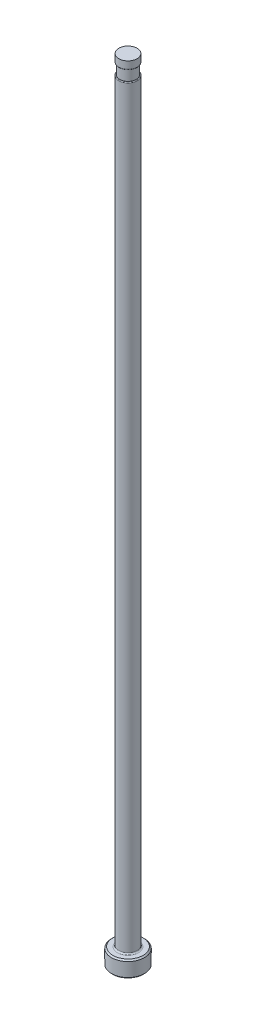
ISO-10303-21;
HEADER;
FILE_DESCRIPTION(('STEP AP214'),'2;1');
FILE_NAME('part.step','',(''),(''),'','','');
FILE_SCHEMA(('AUTOMOTIVE_DESIGN { 1 0 10303 214 1 1 1 1 }'));
ENDSEC;
DATA;
#1=APPLICATION_CONTEXT('core data for automotive mechanical design processes');
#2=APPLICATION_PROTOCOL_DEFINITION('international standard','automotive_design',2000,#1);
#3=PRODUCT_CONTEXT('',#1,'mechanical');
#4=PRODUCT('Part','Part','',(#3));
#5=PRODUCT_RELATED_PRODUCT_CATEGORY('part','',(#4));
#6=PRODUCT_DEFINITION_FORMATION('','',#4);
#7=PRODUCT_DEFINITION_CONTEXT('part definition',#1,'design');
#8=PRODUCT_DEFINITION('design','',#6,#7);
#9=PRODUCT_DEFINITION_SHAPE('','',#8);
#10=(LENGTH_UNIT() NAMED_UNIT(*) SI_UNIT(.MILLI.,.METRE.));
#11=(NAMED_UNIT(*) PLANE_ANGLE_UNIT() SI_UNIT($,.RADIAN.));
#12=(NAMED_UNIT(*) SI_UNIT($,.STERADIAN.) SOLID_ANGLE_UNIT());
#13=UNCERTAINTY_MEASURE_WITH_UNIT(LENGTH_MEASURE(1.E-05),#10,'distance_accuracy_value','');
#14=(GEOMETRIC_REPRESENTATION_CONTEXT(3) GLOBAL_UNCERTAINTY_ASSIGNED_CONTEXT((#13)) GLOBAL_UNIT_ASSIGNED_CONTEXT((#10,
#11,#12)) REPRESENTATION_CONTEXT('',''));
#15=CARTESIAN_POINT('',(0.,0.,0.));
#16=DIRECTION('',(0.,0.,1.));
#17=DIRECTION('',(1.,0.,0.));
#18=AXIS2_PLACEMENT_3D('',#15,#16,#17);
#19=CARTESIAN_POINT('',(-1.78561999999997,150.876,0.));
#20=DIRECTION('',(0.,1.,0.));
#21=DIRECTION('',(0.,0.,1.));
#22=AXIS2_PLACEMENT_3D('',#19,#20,#21);
#23=PLANE('',#22);
#24=CARTESIAN_POINT('',(0.,150.876,0.));
#25=DIRECTION('',(0.,1.,0.));
#26=DIRECTION('',(0.,0.,1.));
#27=AXIS2_PLACEMENT_3D('',#24,#25,#26);
#28=CIRCLE('',#27,1.63321999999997);
#29=CARTESIAN_POINT('',(0.,150.876,1.63321999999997));
#30=VERTEX_POINT('',#29);
#31=EDGE_CURVE('E11',#30,#30,#28,.F.);
#32=ORIENTED_EDGE('',*,*,#31,.T.);
#33=EDGE_LOOP('',(#32));
#34=FACE_BOUND('',#33,.T.);
#35=CARTESIAN_POINT('',(0.,150.876,0.));
#36=DIRECTION('',(0.,1.,0.));
#37=DIRECTION('',(0.,0.,1.));
#38=AXIS2_PLACEMENT_3D('',#35,#36,#37);
#39=CIRCLE('',#38,1.58241999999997);
#40=CARTESIAN_POINT('',(0.,150.876,1.58241999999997));
#41=VERTEX_POINT('',#40);
#42=EDGE_CURVE('E78',#41,#41,#39,.T.);
#43=ORIENTED_EDGE('',*,*,#42,.T.);
#44=EDGE_LOOP('',(#43));
#45=FACE_BOUND('',#44,.T.);
#46=ADVANCED_FACE('F36',(#34,#45),#23,.F.);
#47=CARTESIAN_POINT('',(0.,259.958771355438,0.));
#48=DIRECTION('',(0.,1.,0.));
#49=DIRECTION('',(0.,0.,1.));
#50=AXIS2_PLACEMENT_3D('',#47,#48,#49);
#51=CYLINDRICAL_SURFACE('',#50,1.78561999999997);
#52=DIRECTION('',(0.,1.,0.));
#53=VECTOR('',#52,1.);
#54=CARTESIAN_POINT('',(-1.58241999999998,259.958771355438,-0.827276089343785));
#55=LINE('',#54,#53);
#56=CARTESIAN_POINT('',(-1.58241999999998,148.717,-0.827276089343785));
#57=VERTEX_POINT('',#56);
#58=CARTESIAN_POINT('',(-1.58241999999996,86.36,-0.827276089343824));
#59=VERTEX_POINT('',#58);
#60=EDGE_CURVE('E73',#57,#59,#55,.F.);
#61=ORIENTED_EDGE('',*,*,#60,.F.);
#62=CARTESIAN_POINT('',(0.,148.717,0.));
#63=DIRECTION('',(0.,-1.,0.));
#64=DIRECTION('',(0.,0.,-1.));
#65=AXIS2_PLACEMENT_3D('',#62,#63,#64);
#66=CIRCLE('',#65,1.78561999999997);
#67=CARTESIAN_POINT('',(-1.58241999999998,148.717,0.827276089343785));
#68=VERTEX_POINT('',#67);
#69=EDGE_CURVE('E51',#57,#68,#66,.T.);
#70=ORIENTED_EDGE('',*,*,#69,.T.);
#71=DIRECTION('',(0.,1.,0.));
#72=VECTOR('',#71,1.);
#73=CARTESIAN_POINT('',(-1.58241999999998,259.958771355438,0.827276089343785));
#74=LINE('',#73,#72);
#75=CARTESIAN_POINT('',(-1.58241999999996,86.36,0.827276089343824));
#76=VERTEX_POINT('',#75);
#77=EDGE_CURVE('E84',#76,#68,#74,.T.);
#78=ORIENTED_EDGE('',*,*,#77,.F.);
#79=CARTESIAN_POINT('',(-1.58241999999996,86.36,-0.827276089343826));
#80=CARTESIAN_POINT('',(-1.58241859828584,86.32530589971,-0.827270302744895));
#81=CARTESIAN_POINT('',(-1.58298930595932,86.2906242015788,-0.826188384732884));
#82=CARTESIAN_POINT('',(-1.58525672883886,86.2214213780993,-0.821832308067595));
#83=CARTESIAN_POINT('',(-1.58695392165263,86.1869003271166,-0.818557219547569));
#84=CARTESIAN_POINT('',(-1.59374670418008,86.0832224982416,-0.805306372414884));
#85=CARTESIAN_POINT('',(-1.60054304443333,86.0145662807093,-0.791903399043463));
#86=CARTESIAN_POINT('',(-1.6181445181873,85.8802279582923,-0.755289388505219));
#87=CARTESIAN_POINT('',(-1.62896089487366,85.8145547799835,-0.732050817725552));
#88=CARTESIAN_POINT('',(-1.6535134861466,85.6888437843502,-0.674760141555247));
#89=CARTESIAN_POINT('',(-1.66723753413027,85.6287839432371,-0.640752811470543));
#90=CARTESIAN_POINT('',(-1.69108481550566,85.5355410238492,-0.574000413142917));
#91=CARTESIAN_POINT('',(-1.70092185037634,85.4999825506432,-0.544463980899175));
#92=CARTESIAN_POINT('',(-1.72024188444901,85.4340696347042,-0.479935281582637));
#93=CARTESIAN_POINT('',(-1.72972525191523,85.4037096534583,-0.444948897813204));
#94=CARTESIAN_POINT('',(-1.74591517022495,85.3539989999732,-0.375854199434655));
#95=CARTESIAN_POINT('',(-1.75282315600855,85.3336636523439,-0.342504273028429));
#96=CARTESIAN_POINT('',(-1.76503091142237,85.298596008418,-0.272685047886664));
#97=CARTESIAN_POINT('',(-1.7703313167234,85.2838614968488,-0.236216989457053));
#98=CARTESIAN_POINT('',(-1.77876737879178,85.2607234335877,-0.160839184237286));
#99=CARTESIAN_POINT('',(-1.78189089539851,85.2523553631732,-0.121917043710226));
#100=CARTESIAN_POINT('',(-1.78553515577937,85.2426126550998,-0.0430875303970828));
#101=CARTESIAN_POINT('',(-1.78605699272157,85.2412350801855,-0.00318057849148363));
#102=CARTESIAN_POINT('',(-1.78451570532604,85.245340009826,0.0723170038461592));
#103=CARTESIAN_POINT('',(-1.78269870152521,85.2501692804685,0.107950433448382));
#104=CARTESIAN_POINT('',(-1.77708661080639,85.2653299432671,0.177853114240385));
#105=CARTESIAN_POINT('',(-1.7732916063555,85.2756611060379,0.212122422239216));
#106=CARTESIAN_POINT('',(-1.76403207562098,85.3014906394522,0.278893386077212));
#107=CARTESIAN_POINT('',(-1.75854739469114,85.3170516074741,0.311367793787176));
#108=CARTESIAN_POINT('',(-1.74640529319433,85.3526424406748,0.373513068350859));
#109=CARTESIAN_POINT('',(-1.73974732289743,85.3726744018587,0.403182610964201));
#110=CARTESIAN_POINT('',(-1.72309018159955,85.4248692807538,0.470106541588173));
#111=CARTESIAN_POINT('',(-1.7127837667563,85.4587475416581,0.50595017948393));
#112=CARTESIAN_POINT('',(-1.69205421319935,85.5319822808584,0.571469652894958));
#113=CARTESIAN_POINT('',(-1.68163090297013,85.571348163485,0.601134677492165));
#114=CARTESIAN_POINT('',(-1.65852628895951,85.6667765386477,0.662663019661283));
#115=CARTESIAN_POINT('',(-1.64612995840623,85.7242622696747,0.692421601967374));
#116=CARTESIAN_POINT('',(-1.62408795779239,85.8436981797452,0.742649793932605));
#117=CARTESIAN_POINT('',(-1.61444888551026,85.9056586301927,0.763097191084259));
#118=CARTESIAN_POINT('',(-1.5986900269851,86.0326358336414,0.79558606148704));
#119=CARTESIAN_POINT('',(-1.59259533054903,86.0976709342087,0.807567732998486));
#120=CARTESIAN_POINT('',(-1.58649588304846,86.1958700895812,0.819442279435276));
#121=CARTESIAN_POINT('',(-1.58496990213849,86.2286111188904,0.822384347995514));
#122=CARTESIAN_POINT('',(-1.58293155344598,86.2942312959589,0.826298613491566));
#123=CARTESIAN_POINT('',(-1.58241884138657,86.3271103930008,0.827271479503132));
#124=CARTESIAN_POINT('',(-1.58241999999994,86.3599999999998,0.827276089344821));
#125=B_SPLINE_CURVE_WITH_KNOTS('',3,(#79,#80,#81,#82,#83,#84,#85,#86,#87,#88,#89,#90,#91,#92,
#93,#94,#95,#96,#97,#98,#99,#100,#101,#102,#103,#104,#105,#106,#107,#108,#109,#110,#111,#112,
#113,#114,#115,#116,#117,#118,#119,#120,#121,#122,#123,#124),.UNSPECIFIED.,.F.,.F.,(4,2,2,2,2,2,
2,2,2,2,2,2,2,2,2,2,2,2,2,2,2,2,4),(0.,0.104035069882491,0.208114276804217,0.418101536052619,
0.6286805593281,0.838395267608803,0.979683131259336,1.12081951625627,1.23932997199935,
1.35779350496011,1.47691251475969,1.59598146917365,1.70348686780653,1.81098778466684,
1.91982417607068,2.02871169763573,2.17903977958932,2.32962872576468,2.5262950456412,
2.72342810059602,2.92194014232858,3.02060242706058,3.1192311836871),.UNSPECIFIED.);
#126=EDGE_CURVE('E81',#59,#76,#125,.T.);
#127=ORIENTED_EDGE('',*,*,#126,.F.);
#128=EDGE_LOOP('',(#61,#70,#78,#127));
#129=FACE_BOUND('',#128,.T.);
#130=CARTESIAN_POINT('',(0.,3.42900000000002,0.));
#131=DIRECTION('',(0.,1.,0.));
#132=DIRECTION('',(0.,0.,1.));
#133=AXIS2_PLACEMENT_3D('',#130,#131,#132);
#134=CIRCLE('',#133,1.78561999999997);
#135=CARTESIAN_POINT('',(0.,3.42900000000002,1.78561999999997));
#136=VERTEX_POINT('',#135);
#137=EDGE_CURVE('E116',#136,#136,#134,.T.);
#138=ORIENTED_EDGE('',*,*,#137,.T.);
#139=EDGE_LOOP('',(#138));
#140=FACE_BOUND('',#139,.T.);
#141=ADVANCED_FACE('F82',(#129,#140),#51,.T.);
#142=CARTESIAN_POINT('',(0.,0.,0.));
#143=DIRECTION('',(0.,-1.,0.));
#144=DIRECTION('',(0.,0.,-1.));
#145=AXIS2_PLACEMENT_3D('',#142,#143,#144);
#146=PLANE('',#145);
#147=CARTESIAN_POINT('',(0.,0.,0.));
#148=DIRECTION('',(0.,-1.,0.));
#149=DIRECTION('',(0.,0.,-1.));
#150=AXIS2_PLACEMENT_3D('',#147,#148,#149);
#151=CIRCLE('',#150,2.92099999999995);
#152=CARTESIAN_POINT('',(0.,0.,-2.92099999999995));
#153=VERTEX_POINT('',#152);
#154=EDGE_CURVE('E113',#153,#153,#151,.T.);
#155=ORIENTED_EDGE('',*,*,#154,.T.);
#156=EDGE_LOOP('',(#155));
#157=FACE_BOUND('',#156,.T.);
#158=ADVANCED_FACE('F192',(#157),#146,.T.);
#159=CARTESIAN_POINT('',(0.,259.958771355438,0.));
#160=DIRECTION('',(0.,1.,0.));
#161=DIRECTION('',(0.,0.,1.));
#162=AXIS2_PLACEMENT_3D('',#159,#160,#161);
#163=CYLINDRICAL_SURFACE('',#162,3.17499999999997);
#164=CARTESIAN_POINT('',(0.,2.92100000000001,0.));
#165=DIRECTION('',(0.,1.,0.));
#166=DIRECTION('',(0.,0.,1.));
#167=AXIS2_PLACEMENT_3D('',#164,#165,#166);
#168=CIRCLE('',#167,3.17499999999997);
#169=CARTESIAN_POINT('',(0.,2.92100000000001,3.17499999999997));
#170=VERTEX_POINT('',#169);
#171=EDGE_CURVE('E110',#170,#170,#168,.F.);
#172=ORIENTED_EDGE('',*,*,#171,.T.);
#173=EDGE_LOOP('',(#172));
#174=FACE_BOUND('',#173,.T.);
#175=CARTESIAN_POINT('',(0.,0.254000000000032,0.));
#176=DIRECTION('',(0.,-1.,0.));
#177=DIRECTION('',(0.,0.,-1.));
#178=AXIS2_PLACEMENT_3D('',#175,#176,#177);
#179=CIRCLE('',#178,3.17499999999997);
#180=CARTESIAN_POINT('',(0.,0.254000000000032,-3.17499999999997));
#181=VERTEX_POINT('',#180);
#182=EDGE_CURVE('E107',#181,#181,#179,.F.);
#183=ORIENTED_EDGE('',*,*,#182,.T.);
#184=EDGE_LOOP('',(#183));
#185=FACE_BOUND('',#184,.T.);
#186=ADVANCED_FACE('F195',(#174,#185),#163,.T.);
#187=CARTESIAN_POINT('',(-3.17499999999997,3.175,0.));
#188=DIRECTION('',(0.,1.,0.));
#189=DIRECTION('',(0.,0.,1.));
#190=AXIS2_PLACEMENT_3D('',#187,#188,#189);
#191=PLANE('',#190);
#192=CARTESIAN_POINT('',(0.,3.175,0.));
#193=DIRECTION('',(0.,1.,0.));
#194=DIRECTION('',(0.,0.,1.));
#195=AXIS2_PLACEMENT_3D('',#192,#193,#194);
#196=CIRCLE('',#195,2.03961999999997);
#197=CARTESIAN_POINT('',(0.,3.175,2.03961999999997));
#198=VERTEX_POINT('',#197);
#199=EDGE_CURVE('E87',#198,#198,#196,.F.);
#200=ORIENTED_EDGE('',*,*,#199,.T.);
#201=EDGE_LOOP('',(#200));
#202=FACE_BOUND('',#201,.T.);
#203=CARTESIAN_POINT('',(0.,3.175,0.));
#204=DIRECTION('',(0.,1.,0.));
#205=DIRECTION('',(0.,0.,1.));
#206=AXIS2_PLACEMENT_3D('',#203,#204,#205);
#207=CIRCLE('',#206,2.92099999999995);
#208=CARTESIAN_POINT('',(0.,3.175,2.92099999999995));
#209=VERTEX_POINT('',#208);
#210=EDGE_CURVE('E104',#209,#209,#207,.T.);
#211=ORIENTED_EDGE('',*,*,#210,.T.);
#212=EDGE_LOOP('',(#211));
#213=FACE_BOUND('',#212,.T.);
#214=ADVANCED_FACE('F190',(#202,#213),#191,.T.);
#215=CARTESIAN_POINT('',(0.,3.17499999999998,0.));
#216=DIRECTION('',(0.,-1.,0.));
#217=DIRECTION('',(0.,0.,-1.));
#218=AXIS2_PLACEMENT_3D('',#215,#216,#217);
#219=CONICAL_SURFACE('',#218,2.92099999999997,0.7853981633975);
#220=ORIENTED_EDGE('',*,*,#171,.F.);
#221=EDGE_LOOP('',(#220));
#222=FACE_BOUND('',#221,.T.);
#223=ORIENTED_EDGE('',*,*,#210,.F.);
#224=EDGE_LOOP('',(#223));
#225=FACE_BOUND('',#224,.T.);
#226=ADVANCED_FACE('F186',(#222,#225),#219,.T.);
#227=CARTESIAN_POINT('',(0.,0.254000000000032,0.));
#228=DIRECTION('',(0.,1.,0.));
#229=DIRECTION('',(0.,0.,1.));
#230=AXIS2_PLACEMENT_3D('',#227,#228,#229);
#231=CONICAL_SURFACE('',#230,3.17499999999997,0.785398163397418);
#232=ORIENTED_EDGE('',*,*,#154,.F.);
#233=EDGE_LOOP('',(#232));
#234=FACE_BOUND('',#233,.T.);
#235=ORIENTED_EDGE('',*,*,#182,.F.);
#236=EDGE_LOOP('',(#235));
#237=FACE_BOUND('',#236,.T.);
#238=ADVANCED_FACE('F182',(#234,#237),#231,.T.);
#239=CARTESIAN_POINT('',(0.,3.42900000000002,0.));
#240=DIRECTION('',(0.,1.,0.));
#241=DIRECTION('',(0.,0.,1.));
#242=AXIS2_PLACEMENT_3D('',#239,#240,#241);
#243=TOROIDAL_SURFACE('',#242,2.03961999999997,0.254);
#244=ORIENTED_EDGE('',*,*,#199,.F.);
#245=EDGE_LOOP('',(#244));
#246=FACE_BOUND('',#245,.T.);
#247=ORIENTED_EDGE('',*,*,#137,.F.);
#248=EDGE_LOOP('',(#247));
#249=FACE_BOUND('',#248,.T.);
#250=ADVANCED_FACE('F147',(#246,#249),#243,.F.);
#251=CARTESIAN_POINT('',(-1.78561999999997,148.844,0.));
#252=DIRECTION('',(0.,-1.,0.));
#253=DIRECTION('',(0.,0.,-1.));
#254=AXIS2_PLACEMENT_3D('',#251,#252,#253);
#255=PLANE('',#254);
#256=DIRECTION('',(0.,0.,1.));
#257=VECTOR('',#256,1.);
#258=CARTESIAN_POINT('',(-1.58241999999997,148.844,0.));
#259=LINE('',#258,#257);
#260=CARTESIAN_POINT('',(-1.58241999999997,148.844,0.));
#261=VERTEX_POINT('',#260);
#262=CARTESIAN_POINT('',(-1.58241999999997,148.844,0.496957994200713));
#263=VERTEX_POINT('',#262);
#264=EDGE_CURVE('E90',#261,#263,#259,.T.);
#265=ORIENTED_EDGE('',*,*,#264,.T.);
#266=CARTESIAN_POINT('',(0.,148.844,0.));
#267=DIRECTION('',(0.,-1.,0.));
#268=DIRECTION('',(0.,0.,-1.));
#269=AXIS2_PLACEMENT_3D('',#266,#267,#268);
#270=CIRCLE('',#269,1.65861999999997);
#271=CARTESIAN_POINT('',(-1.58241999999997,148.844,-0.496957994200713));
#272=VERTEX_POINT('',#271);
#273=EDGE_CURVE('E86',#263,#272,#270,.F.);
#274=ORIENTED_EDGE('',*,*,#273,.T.);
#275=EDGE_CURVE('E79',#272,#261,#259,.T.);
#276=ORIENTED_EDGE('',*,*,#275,.T.);
#277=CARTESIAN_POINT('',(0.,148.844,0.));
#278=DIRECTION('',(0.,1.,0.));
#279=DIRECTION('',(0.,0.,1.));
#280=AXIS2_PLACEMENT_3D('',#277,#278,#279);
#281=CIRCLE('',#280,1.58241999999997);
#282=EDGE_CURVE('E101',#261,#261,#281,.T.);
#283=ORIENTED_EDGE('',*,*,#282,.F.);
#284=EDGE_LOOP('',(#265,#274,#276,#283));
#285=FACE_BOUND('',#284,.T.);
#286=ADVANCED_FACE('F144',(#285),#255,.F.);
#287=CARTESIAN_POINT('',(0.,153.448281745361,0.));
#288=DIRECTION('',(0.,1.,0.));
#289=DIRECTION('',(0.,0.,1.));
#290=AXIS2_PLACEMENT_3D('',#287,#288,#289);
#291=CYLINDRICAL_SURFACE('',#290,1.58241999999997);
#292=ORIENTED_EDGE('',*,*,#42,.F.);
#293=EDGE_LOOP('',(#292));
#294=FACE_BOUND('',#293,.T.);
#295=ORIENTED_EDGE('',*,*,#282,.T.);
#296=EDGE_LOOP('',(#295));
#297=FACE_BOUND('',#296,.T.);
#298=ADVANCED_FACE('F141',(#294,#297),#291,.T.);
#299=CARTESIAN_POINT('',(-1.58241999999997,149.86,-3.17499999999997));
#300=DIRECTION('',(1.,0.,0.));
#301=DIRECTION('',(0.,1.,0.));
#302=AXIS2_PLACEMENT_3D('',#299,#300,#301);
#303=PLANE('',#302);
#304=ORIENTED_EDGE('',*,*,#275,.F.);
#305=CARTESIAN_POINT('',(-1.58241999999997,148.844,-0.496957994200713));
#306=CARTESIAN_POINT('',(-1.58241999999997,148.843990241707,-0.513789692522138));
#307=CARTESIAN_POINT('',(-1.58241999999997,148.84369820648,-0.530633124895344));
#308=CARTESIAN_POINT('',(-1.58241999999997,148.842318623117,-0.56437499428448));
#309=CARTESIAN_POINT('',(-1.58241999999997,148.841226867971,-0.58127324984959));
#310=CARTESIAN_POINT('',(-1.58241999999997,148.838012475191,-0.614973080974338));
#311=CARTESIAN_POINT('',(-1.58241999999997,148.835890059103,-0.631774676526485));
#312=CARTESIAN_POINT('',(-1.58241999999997,148.830280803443,-0.665126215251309));
#313=CARTESIAN_POINT('',(-1.58241999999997,148.826797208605,-0.681676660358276));
#314=CARTESIAN_POINT('',(-1.58241999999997,148.820084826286,-0.706389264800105));
#315=CARTESIAN_POINT('',(-1.58241999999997,148.817547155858,-0.71473825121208));
#316=CARTESIAN_POINT('',(-1.58241999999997,148.81184368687,-0.731264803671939));
#317=CARTESIAN_POINT('',(-1.58241999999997,148.808675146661,-0.73944144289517));
#318=CARTESIAN_POINT('',(-1.58241999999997,148.800581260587,-0.757712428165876));
#319=CARTESIAN_POINT('',(-1.58241999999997,148.795412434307,-0.767701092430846));
#320=CARTESIAN_POINT('',(-1.58241999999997,148.783398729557,-0.786606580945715));
#321=CARTESIAN_POINT('',(-1.58241999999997,148.776567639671,-0.795531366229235));
#322=CARTESIAN_POINT('',(-1.58241999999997,148.765582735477,-0.806320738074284));
#323=CARTESIAN_POINT('',(-1.58241999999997,148.762377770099,-0.809143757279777));
#324=CARTESIAN_POINT('',(-1.58241999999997,148.755610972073,-0.814338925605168));
#325=CARTESIAN_POINT('',(-1.58241999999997,148.752048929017,-0.81671080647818));
#326=CARTESIAN_POINT('',(-1.58241999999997,148.744529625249,-0.820873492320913));
#327=CARTESIAN_POINT('',(-1.58241999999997,148.740567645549,-0.822655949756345));
#328=CARTESIAN_POINT('',(-1.58241999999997,148.73237382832,-0.825404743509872));
#329=CARTESIAN_POINT('',(-1.58241999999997,148.728143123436,-0.826374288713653));
#330=CARTESIAN_POINT('',(-1.58241999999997,148.722726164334,-0.82700858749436));
#331=CARTESIAN_POINT('',(-1.58241999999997,148.721583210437,-0.82710876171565));
#332=CARTESIAN_POINT('',(-1.58241999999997,148.719293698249,-0.827242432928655));
#333=CARTESIAN_POINT('',(-1.58241999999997,148.718147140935,-0.827275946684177));
#334=CARTESIAN_POINT('',(-1.58241999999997,148.717,-0.827276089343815));
#335=B_SPLINE_CURVE_WITH_KNOTS('',3,(#305,#306,#307,#308,#309,#310,#311,#312,#313,#314,#315,
#316,#317,#318,#319,#320,#321,#322,#323,#324,#325,#326,#327,#328,#329,#330,#331,#332,#333,#334),
.UNSPECIFIED.,.F.,.F.,(4,2,2,2,2,2,2,2,2,2,2,2,2,2,4),(0.,0.0505111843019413,0.101290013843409,
0.152057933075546,0.202705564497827,0.228865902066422,0.2551425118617,0.288792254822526,
0.322171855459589,0.334955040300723,0.347745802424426,0.360710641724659,0.373624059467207,
0.377064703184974,0.380504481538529),.UNSPECIFIED.);
#336=EDGE_CURVE('E59',#272,#57,#335,.T.);
#337=ORIENTED_EDGE('',*,*,#336,.T.);
#338=ORIENTED_EDGE('',*,*,#60,.T.);
#339=DIRECTION('',(0.,0.,1.));
#340=VECTOR('',#339,1.);
#341=CARTESIAN_POINT('',(-1.58241999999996,86.36,-3.17499999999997));
#342=LINE('',#341,#340);
#343=EDGE_CURVE('E77',#59,#76,#342,.T.);
#344=ORIENTED_EDGE('',*,*,#343,.T.);
#345=ORIENTED_EDGE('',*,*,#77,.T.);
#346=CARTESIAN_POINT('',(-1.58241999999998,148.717,0.827276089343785));
#347=CARTESIAN_POINT('',(-1.58241999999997,148.720578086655,0.827284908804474));
#348=CARTESIAN_POINT('',(-1.58241999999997,148.724145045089,0.826950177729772));
#349=CARTESIAN_POINT('',(-1.58241999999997,148.731132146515,0.825674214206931));
#350=CARTESIAN_POINT('',(-1.58241999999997,148.734553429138,0.824739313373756));
#351=CARTESIAN_POINT('',(-1.58241999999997,148.741944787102,0.822072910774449));
#352=CARTESIAN_POINT('',(-1.58241999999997,148.745866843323,0.8202101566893));
#353=CARTESIAN_POINT('',(-1.58241999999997,148.753366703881,0.815871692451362));
#354=CARTESIAN_POINT('',(-1.58241999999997,148.756942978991,0.813393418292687));
#355=CARTESIAN_POINT('',(-1.58241999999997,148.765559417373,0.806534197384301));
#356=CARTESIAN_POINT('',(-1.58241999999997,148.770353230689,0.801846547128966));
#357=CARTESIAN_POINT('',(-1.58241999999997,148.779183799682,0.791817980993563));
#358=CARTESIAN_POINT('',(-1.58241999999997,148.783219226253,0.786475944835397));
#359=CARTESIAN_POINT('',(-1.58241999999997,148.793959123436,0.770471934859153));
#360=CARTESIAN_POINT('',(-1.58241999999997,148.799868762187,0.759282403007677));
#361=CARTESIAN_POINT('',(-1.58241999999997,148.810145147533,0.736160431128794));
#362=CARTESIAN_POINT('',(-1.58241999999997,148.814499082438,0.724222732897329));
#363=CARTESIAN_POINT('',(-1.58241999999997,148.823780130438,0.694353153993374));
#364=CARTESIAN_POINT('',(-1.58241999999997,148.828032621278,0.676214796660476));
#365=CARTESIAN_POINT('',(-1.58241999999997,148.834803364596,0.639581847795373));
#366=CARTESIAN_POINT('',(-1.58241999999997,148.837315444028,0.621086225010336));
#367=CARTESIAN_POINT('',(-1.58241999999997,148.840962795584,0.584931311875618));
#368=CARTESIAN_POINT('',(-1.58241999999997,148.842162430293,0.567278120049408));
#369=CARTESIAN_POINT('',(-1.58241999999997,148.843671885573,0.532064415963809));
#370=CARTESIAN_POINT('',(-1.58241999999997,148.843988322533,0.514504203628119));
#371=CARTESIAN_POINT('',(-1.58241999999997,148.844,0.496957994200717));
#372=B_SPLINE_CURVE_WITH_KNOTS('',3,(#346,#347,#348,#349,#350,#351,#352,#353,#354,#355,#356,
#357,#358,#359,#360,#361,#362,#363,#364,#365,#366,#367,#368,#369,#370,#371),.UNSPECIFIED.,.F.,
.F.,(4,2,2,2,2,2,2,2,2,2,2,2,4),(0.,0.0107006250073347,0.0212901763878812,0.0342440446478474,
0.0472528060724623,0.0672536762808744,0.0872892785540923,0.12503975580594,0.163094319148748,
0.218841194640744,0.274784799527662,0.32784131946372,0.38049929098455),.UNSPECIFIED.);
#373=EDGE_CURVE('E172',#68,#263,#372,.T.);
#374=ORIENTED_EDGE('',*,*,#373,.T.);
#375=ORIENTED_EDGE('',*,*,#264,.F.);
#376=EDGE_LOOP('',(#304,#337,#338,#344,#345,#374,#375));
#377=FACE_BOUND('',#376,.T.);
#378=ADVANCED_FACE('F75',(#377),#303,.F.);
#379=CARTESIAN_POINT('',(-4.75741999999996,86.36,-3.17499999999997));
#380=DIRECTION('',(0.,0.,1.));
#381=DIRECTION('',(1.,0.,0.));
#382=AXIS2_PLACEMENT_3D('',#379,#380,#381);
#383=CYLINDRICAL_SURFACE('',#382,3.175);
#384=ORIENTED_EDGE('',*,*,#343,.F.);
#385=ORIENTED_EDGE('',*,*,#126,.T.);
#386=EDGE_LOOP('',(#384,#385));
#387=FACE_BOUND('',#386,.T.);
#388=ADVANCED_FACE('F89',(#387),#383,.F.);
#389=CARTESIAN_POINT('',(0.,152.687735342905,0.));
#390=DIRECTION('',(0.,1.,0.));
#391=DIRECTION('',(0.,0.,1.));
#392=AXIS2_PLACEMENT_3D('',#389,#390,#391);
#393=CYLINDRICAL_SURFACE('',#392,1.76021999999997);
#394=CARTESIAN_POINT('',(0.,151.003,0.));
#395=DIRECTION('',(0.,1.,0.));
#396=DIRECTION('',(0.,0.,1.));
#397=AXIS2_PLACEMENT_3D('',#394,#395,#396);
#398=CIRCLE('',#397,1.76021999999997);
#399=CARTESIAN_POINT('',(0.,151.003,1.76021999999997));
#400=VERTEX_POINT('',#399);
#401=EDGE_CURVE('E44',#400,#400,#398,.T.);
#402=ORIENTED_EDGE('',*,*,#401,.T.);
#403=EDGE_LOOP('',(#402));
#404=FACE_BOUND('',#403,.T.);
#405=CARTESIAN_POINT('',(0.,152.4,0.));
#406=DIRECTION('',(0.,1.,0.));
#407=DIRECTION('',(0.,0.,1.));
#408=AXIS2_PLACEMENT_3D('',#405,#406,#407);
#409=CIRCLE('',#408,1.76021999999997);
#410=CARTESIAN_POINT('',(0.,152.4,1.76021999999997));
#411=VERTEX_POINT('',#410);
#412=EDGE_CURVE('E91',#411,#411,#409,.T.);
#413=ORIENTED_EDGE('',*,*,#412,.F.);
#414=EDGE_LOOP('',(#413));
#415=FACE_BOUND('',#414,.T.);
#416=ADVANCED_FACE('F135',(#404,#415),#393,.T.);
#417=CARTESIAN_POINT('',(-1.78561999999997,152.4,0.));
#418=DIRECTION('',(0.,1.,0.));
#419=DIRECTION('',(0.,0.,1.));
#420=AXIS2_PLACEMENT_3D('',#417,#418,#419);
#421=PLANE('',#420);
#422=ORIENTED_EDGE('',*,*,#412,.T.);
#423=EDGE_LOOP('',(#422));
#424=FACE_BOUND('',#423,.T.);
#425=ADVANCED_FACE('F149',(#424),#421,.T.);
#426=CARTESIAN_POINT('',(0.,148.717,0.));
#427=DIRECTION('',(0.,-1.,0.));
#428=DIRECTION('',(0.,0.,-1.));
#429=AXIS2_PLACEMENT_3D('',#426,#427,#428);
#430=TOROIDAL_SURFACE('',#429,1.65861999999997,0.127);
#431=ORIENTED_EDGE('',*,*,#373,.F.);
#432=ORIENTED_EDGE('',*,*,#69,.F.);
#433=ORIENTED_EDGE('',*,*,#336,.F.);
#434=ORIENTED_EDGE('',*,*,#273,.F.);
#435=EDGE_LOOP('',(#431,#432,#433,#434));
#436=FACE_BOUND('',#435,.T.);
#437=ADVANCED_FACE('F151',(#436),#430,.T.);
#438=CARTESIAN_POINT('',(0.,151.003,0.));
#439=DIRECTION('',(0.,1.,0.));
#440=DIRECTION('',(0.,0.,1.));
#441=AXIS2_PLACEMENT_3D('',#438,#439,#440);
#442=TOROIDAL_SURFACE('',#441,1.63321999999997,0.127);
#443=ORIENTED_EDGE('',*,*,#31,.F.);
#444=EDGE_LOOP('',(#443));
#445=FACE_BOUND('',#444,.T.);
#446=ORIENTED_EDGE('',*,*,#401,.F.);
#447=EDGE_LOOP('',(#446));
#448=FACE_BOUND('',#447,.T.);
#449=ADVANCED_FACE('F38',(#445,#448),#442,.T.);
#450=CLOSED_SHELL('',(#46,#141,#158,#186,#214,#226,#238,#250,#286,#298,#378,#388,#416,#425,#437,#449));
#451=MANIFOLD_SOLID_BREP('B2',#450);
#452=ADVANCED_BREP_SHAPE_REPRESENTATION('',(#18,#451),#14);
#453=SHAPE_DEFINITION_REPRESENTATION(#9,#452);
ENDSEC;
END-ISO-10303-21;
